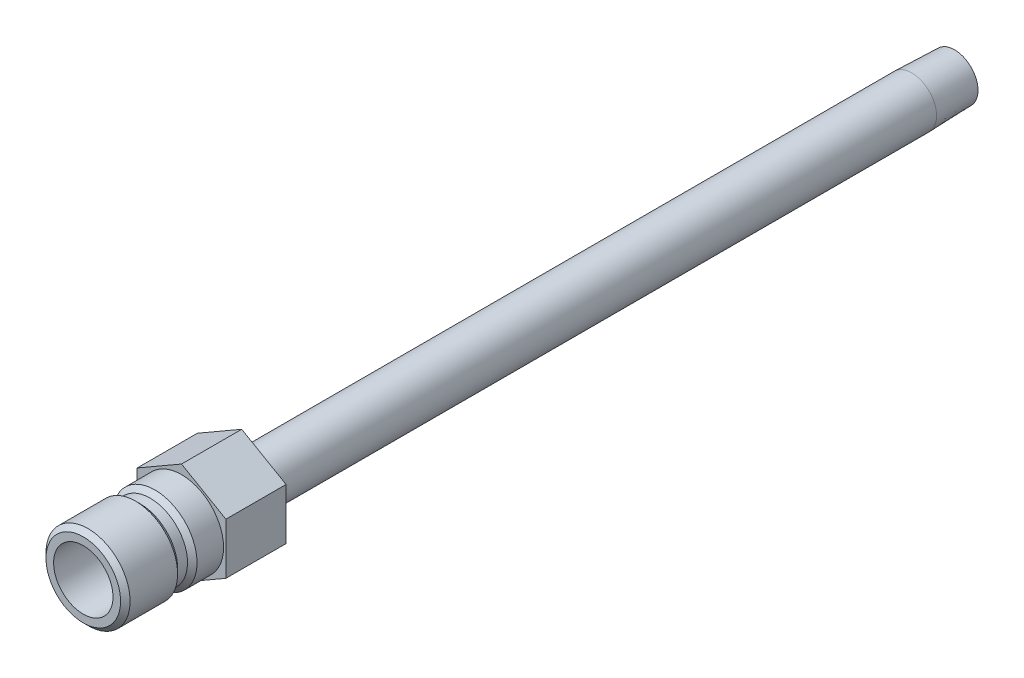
ISO-10303-21;
HEADER;
FILE_DESCRIPTION(('STEP AP214'),'2;1');
FILE_NAME('part.step','',(''),(''),'','','');
FILE_SCHEMA(('AUTOMOTIVE_DESIGN { 1 0 10303 214 1 1 1 1 }'));
ENDSEC;
DATA;
#1=APPLICATION_CONTEXT('core data for automotive mechanical design processes');
#2=APPLICATION_PROTOCOL_DEFINITION('international standard','automotive_design',2000,#1);
#3=PRODUCT_CONTEXT('',#1,'mechanical');
#4=PRODUCT('Part','Part','',(#3));
#5=PRODUCT_RELATED_PRODUCT_CATEGORY('part','',(#4));
#6=PRODUCT_DEFINITION_FORMATION('','',#4);
#7=PRODUCT_DEFINITION_CONTEXT('part definition',#1,'design');
#8=PRODUCT_DEFINITION('design','',#6,#7);
#9=PRODUCT_DEFINITION_SHAPE('','',#8);
#10=(LENGTH_UNIT() NAMED_UNIT(*) SI_UNIT(.MILLI.,.METRE.));
#11=(NAMED_UNIT(*) PLANE_ANGLE_UNIT() SI_UNIT($,.RADIAN.));
#12=(NAMED_UNIT(*) SI_UNIT($,.STERADIAN.) SOLID_ANGLE_UNIT());
#13=UNCERTAINTY_MEASURE_WITH_UNIT(LENGTH_MEASURE(1.E-05),#10,'distance_accuracy_value','');
#14=(GEOMETRIC_REPRESENTATION_CONTEXT(3) GLOBAL_UNCERTAINTY_ASSIGNED_CONTEXT((#13)) GLOBAL_UNIT_ASSIGNED_CONTEXT((#10,
#11,#12)) REPRESENTATION_CONTEXT('',''));
#15=CARTESIAN_POINT('',(0.,0.,0.));
#16=DIRECTION('',(0.,0.,1.));
#17=DIRECTION('',(1.,0.,0.));
#18=AXIS2_PLACEMENT_3D('',#15,#16,#17);
#19=CARTESIAN_POINT('',(0.,0.,-9.652));
#20=DIRECTION('',(0.,0.,-1.));
#21=DIRECTION('',(0.,1.,0.));
#22=AXIS2_PLACEMENT_3D('',#19,#20,#21);
#23=CYLINDRICAL_SURFACE('',#22,2.65430000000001);
#24=CARTESIAN_POINT('',(0.,0.,2.43505017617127));
#25=DIRECTION('',(0.,0.,-1.));
#26=DIRECTION('',(0.,1.,0.));
#27=AXIS2_PLACEMENT_3D('',#24,#25,#26);
#28=CIRCLE('',#27,2.6543);
#29=CARTESIAN_POINT('',(0.,2.6543,2.43505017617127));
#30=VERTEX_POINT('',#29);
#31=EDGE_CURVE('E41',#30,#30,#28,.T.);
#32=ORIENTED_EDGE('',*,*,#31,.F.);
#33=EDGE_LOOP('',(#32));
#34=FACE_BOUND('',#33,.T.);
#35=CARTESIAN_POINT('',(0.,0.,-123.952));
#36=DIRECTION('',(0.,0.,-1.));
#37=DIRECTION('',(0.,1.,0.));
#38=AXIS2_PLACEMENT_3D('',#35,#36,#37);
#39=CIRCLE('',#38,2.65430000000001);
#40=CARTESIAN_POINT('',(0.,2.65430000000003,-123.952));
#41=VERTEX_POINT('',#40);
#42=EDGE_CURVE('E137',#41,#41,#39,.T.);
#43=ORIENTED_EDGE('',*,*,#42,.T.);
#44=EDGE_LOOP('',(#43));
#45=FACE_BOUND('',#44,.T.);
#46=ADVANCED_FACE('F33',(#34,#45),#23,.F.);
#47=CARTESIAN_POINT('',(0.,0.,3.556));
#48=DIRECTION('',(0.,0.,1.));
#49=DIRECTION('',(0.,-1.,0.));
#50=AXIS2_PLACEMENT_3D('',#47,#48,#49);
#51=CONICAL_SURFACE('',#50,4.7625,1.08210413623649);
#52=ORIENTED_EDGE('',*,*,#31,.T.);
#53=EDGE_LOOP('',(#52));
#54=FACE_BOUND('',#53,.T.);
#55=CARTESIAN_POINT('',(0.,0.,3.556));
#56=DIRECTION('',(0.,0.,-1.));
#57=DIRECTION('',(0.,1.,0.));
#58=AXIS2_PLACEMENT_3D('',#55,#56,#57);
#59=CIRCLE('',#58,4.7625);
#60=CARTESIAN_POINT('',(0.,4.7625,3.556));
#61=VERTEX_POINT('',#60);
#62=EDGE_CURVE('E175',#61,#61,#59,.T.);
#63=ORIENTED_EDGE('',*,*,#62,.F.);
#64=EDGE_LOOP('',(#63));
#65=FACE_BOUND('',#64,.T.);
#66=ADVANCED_FACE('F180',(#54,#65),#51,.F.);
#67=CARTESIAN_POINT('',(0.,0.,-9.652));
#68=DIRECTION('',(0.,0.,-1.));
#69=DIRECTION('',(0.,1.,0.));
#70=AXIS2_PLACEMENT_3D('',#67,#68,#69);
#71=CYLINDRICAL_SURFACE('',#70,4.7625);
#72=ORIENTED_EDGE('',*,*,#62,.T.);
#73=EDGE_LOOP('',(#72));
#74=FACE_BOUND('',#73,.T.);
#75=CARTESIAN_POINT('',(0.,0.,15.748));
#76=DIRECTION('',(0.,0.,-1.));
#77=DIRECTION('',(0.,1.,0.));
#78=AXIS2_PLACEMENT_3D('',#75,#76,#77);
#79=CIRCLE('',#78,4.7625);
#80=CARTESIAN_POINT('',(0.,4.7625,15.748));
#81=VERTEX_POINT('',#80);
#82=EDGE_CURVE('E172',#81,#81,#79,.T.);
#83=ORIENTED_EDGE('',*,*,#82,.F.);
#84=EDGE_LOOP('',(#83));
#85=FACE_BOUND('',#84,.T.);
#86=ADVANCED_FACE('F237',(#74,#85),#71,.F.);
#87=CARTESIAN_POINT('',(0.,4.7625,15.748));
#88=DIRECTION('',(0.,0.,1.));
#89=DIRECTION('',(0.,-1.,0.));
#90=AXIS2_PLACEMENT_3D('',#87,#88,#89);
#91=PLANE('',#90);
#92=ORIENTED_EDGE('',*,*,#82,.T.);
#93=EDGE_LOOP('',(#92));
#94=FACE_BOUND('',#93,.T.);
#95=CARTESIAN_POINT('',(0.,0.,15.748));
#96=DIRECTION('',(0.,0.,-1.));
#97=DIRECTION('',(0.,1.,0.));
#98=AXIS2_PLACEMENT_3D('',#95,#96,#97);
#99=CIRCLE('',#98,5.9817);
#100=CARTESIAN_POINT('',(0.,5.9817,15.748));
#101=VERTEX_POINT('',#100);
#102=EDGE_CURVE('E169',#101,#101,#99,.T.);
#103=ORIENTED_EDGE('',*,*,#102,.F.);
#104=EDGE_LOOP('',(#103));
#105=FACE_BOUND('',#104,.T.);
#106=ADVANCED_FACE('F233',(#94,#105),#91,.T.);
#107=CARTESIAN_POINT('',(0.,0.,14.986));
#108=DIRECTION('',(0.,0.,-1.));
#109=DIRECTION('',(0.,1.,0.));
#110=AXIS2_PLACEMENT_3D('',#107,#108,#109);
#111=CONICAL_SURFACE('',#110,6.7437,0.785398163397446);
#112=ORIENTED_EDGE('',*,*,#102,.T.);
#113=EDGE_LOOP('',(#112));
#114=FACE_BOUND('',#113,.T.);
#115=CARTESIAN_POINT('',(0.,0.,14.986));
#116=DIRECTION('',(0.,0.,-1.));
#117=DIRECTION('',(0.,1.,0.));
#118=AXIS2_PLACEMENT_3D('',#115,#116,#117);
#119=CIRCLE('',#118,6.7437);
#120=CARTESIAN_POINT('',(0.,6.7437,14.986));
#121=VERTEX_POINT('',#120);
#122=EDGE_CURVE('E166',#121,#121,#119,.T.);
#123=ORIENTED_EDGE('',*,*,#122,.F.);
#124=EDGE_LOOP('',(#123));
#125=FACE_BOUND('',#124,.T.);
#126=ADVANCED_FACE('F229',(#114,#125),#111,.T.);
#127=CARTESIAN_POINT('',(0.,0.,-9.652));
#128=DIRECTION('',(0.,0.,-1.));
#129=DIRECTION('',(0.,1.,0.));
#130=AXIS2_PLACEMENT_3D('',#127,#128,#129);
#131=CYLINDRICAL_SURFACE('',#130,6.7437);
#132=ORIENTED_EDGE('',*,*,#122,.T.);
#133=EDGE_LOOP('',(#132));
#134=FACE_BOUND('',#133,.T.);
#135=CARTESIAN_POINT('',(0.,0.,7.366));
#136=DIRECTION('',(0.,0.,-1.));
#137=DIRECTION('',(0.,1.,0.));
#138=AXIS2_PLACEMENT_3D('',#135,#136,#137);
#139=CIRCLE('',#138,6.7437);
#140=CARTESIAN_POINT('',(0.,6.7437,7.366));
#141=VERTEX_POINT('',#140);
#142=EDGE_CURVE('E163',#141,#141,#139,.T.);
#143=ORIENTED_EDGE('',*,*,#142,.F.);
#144=EDGE_LOOP('',(#143));
#145=FACE_BOUND('',#144,.T.);
#146=ADVANCED_FACE('F225',(#134,#145),#131,.T.);
#147=CARTESIAN_POINT('',(0.,0.,6.604));
#148=DIRECTION('',(0.,0.,1.));
#149=DIRECTION('',(0.,-1.,0.));
#150=AXIS2_PLACEMENT_3D('',#147,#148,#149);
#151=CONICAL_SURFACE('',#150,5.9817,0.785398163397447);
#152=ORIENTED_EDGE('',*,*,#142,.T.);
#153=EDGE_LOOP('',(#152));
#154=FACE_BOUND('',#153,.T.);
#155=CARTESIAN_POINT('',(0.,0.,6.604));
#156=DIRECTION('',(0.,0.,-1.));
#157=DIRECTION('',(0.,1.,0.));
#158=AXIS2_PLACEMENT_3D('',#155,#156,#157);
#159=CIRCLE('',#158,5.9817);
#160=CARTESIAN_POINT('',(0.,5.9817,6.604));
#161=VERTEX_POINT('',#160);
#162=EDGE_CURVE('E160',#161,#161,#159,.T.);
#163=ORIENTED_EDGE('',*,*,#162,.F.);
#164=EDGE_LOOP('',(#163));
#165=FACE_BOUND('',#164,.T.);
#166=ADVANCED_FACE('F221',(#154,#165),#151,.T.);
#167=CARTESIAN_POINT('',(0.,0.,-9.652));
#168=DIRECTION('',(0.,0.,-1.));
#169=DIRECTION('',(0.,1.,0.));
#170=AXIS2_PLACEMENT_3D('',#167,#168,#169);
#171=CYLINDRICAL_SURFACE('',#170,5.9817);
#172=ORIENTED_EDGE('',*,*,#162,.T.);
#173=EDGE_LOOP('',(#172));
#174=FACE_BOUND('',#173,.T.);
#175=CARTESIAN_POINT('',(0.,0.,5.0165));
#176=DIRECTION('',(0.,0.,-1.));
#177=DIRECTION('',(0.,1.,0.));
#178=AXIS2_PLACEMENT_3D('',#175,#176,#177);
#179=CIRCLE('',#178,5.9817);
#180=CARTESIAN_POINT('',(0.,5.9817,5.0165));
#181=VERTEX_POINT('',#180);
#182=EDGE_CURVE('E157',#181,#181,#179,.T.);
#183=ORIENTED_EDGE('',*,*,#182,.F.);
#184=EDGE_LOOP('',(#183));
#185=FACE_BOUND('',#184,.T.);
#186=ADVANCED_FACE('F217',(#174,#185),#171,.T.);
#187=CARTESIAN_POINT('',(0.,0.,4.25449999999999));
#188=DIRECTION('',(0.,0.,-1.));
#189=DIRECTION('',(0.,1.,0.));
#190=AXIS2_PLACEMENT_3D('',#187,#188,#189);
#191=CONICAL_SURFACE('',#190,6.7437,0.785398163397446);
#192=ORIENTED_EDGE('',*,*,#182,.T.);
#193=EDGE_LOOP('',(#192));
#194=FACE_BOUND('',#193,.T.);
#195=CARTESIAN_POINT('',(0.,0.,4.25449999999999));
#196=DIRECTION('',(0.,0.,-1.));
#197=DIRECTION('',(0.,1.,0.));
#198=AXIS2_PLACEMENT_3D('',#195,#196,#197);
#199=CIRCLE('',#198,6.7437);
#200=CARTESIAN_POINT('',(0.,6.7437,4.25449999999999));
#201=VERTEX_POINT('',#200);
#202=EDGE_CURVE('E154',#201,#201,#199,.T.);
#203=ORIENTED_EDGE('',*,*,#202,.F.);
#204=EDGE_LOOP('',(#203));
#205=FACE_BOUND('',#204,.T.);
#206=ADVANCED_FACE('F213',(#194,#205),#191,.T.);
#207=CARTESIAN_POINT('',(0.,0.,-9.652));
#208=DIRECTION('',(0.,0.,-1.));
#209=DIRECTION('',(0.,1.,0.));
#210=AXIS2_PLACEMENT_3D('',#207,#208,#209);
#211=CYLINDRICAL_SURFACE('',#210,6.7437);
#212=CARTESIAN_POINT('',(0.,0.,0.));
#213=DIRECTION('',(0.,0.,1.));
#214=DIRECTION('',(1.,0.,0.));
#215=AXIS2_PLACEMENT_3D('',#212,#213,#214);
#216=CIRCLE('',#215,6.7437);
#217=CARTESIAN_POINT('',(6.7437,0.,0.));
#218=VERTEX_POINT('',#217);
#219=EDGE_CURVE('E11',#218,#218,#216,.F.);
#220=ORIENTED_EDGE('',*,*,#219,.F.);
#221=EDGE_LOOP('',(#220));
#222=FACE_BOUND('',#221,.T.);
#223=ORIENTED_EDGE('',*,*,#202,.T.);
#224=EDGE_LOOP('',(#223));
#225=FACE_BOUND('',#224,.T.);
#226=ADVANCED_FACE('F209',(#222,#225),#211,.T.);
#227=CARTESIAN_POINT('',(0.,6.7437,-9.652));
#228=DIRECTION('',(0.,0.,-1.));
#229=DIRECTION('',(0.,1.,0.));
#230=AXIS2_PLACEMENT_3D('',#227,#228,#229);
#231=PLANE('',#230);
#232=CARTESIAN_POINT('',(0.,0.,-9.652));
#233=DIRECTION('',(0.,0.,-1.));
#234=DIRECTION('',(0.,1.,0.));
#235=AXIS2_PLACEMENT_3D('',#232,#233,#234);
#236=CIRCLE('',#235,3.96875);
#237=CARTESIAN_POINT('',(0.,3.96875,-9.652));
#238=VERTEX_POINT('',#237);
#239=EDGE_CURVE('E151',#238,#238,#236,.T.);
#240=ORIENTED_EDGE('',*,*,#239,.F.);
#241=EDGE_LOOP('',(#240));
#242=FACE_BOUND('',#241,.T.);
#243=DIRECTION('',(-0.866025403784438,-0.5,0.));
#244=VECTOR('',#243,1.);
#245=CARTESIAN_POINT('',(0.,8.21223022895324,-9.652));
#246=LINE('',#245,#244);
#247=CARTESIAN_POINT('',(0.,8.21223022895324,-9.652));
#248=VERTEX_POINT('',#247);
#249=CARTESIAN_POINT('',(-7.112,4.10611511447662,-9.652));
#250=VERTEX_POINT('',#249);
#251=EDGE_CURVE('E135',#248,#250,#246,.T.);
#252=ORIENTED_EDGE('',*,*,#251,.F.);
#253=DIRECTION('',(-0.866025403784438,0.5,0.));
#254=VECTOR('',#253,1.);
#255=CARTESIAN_POINT('',(7.112,4.10611511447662,-9.652));
#256=LINE('',#255,#254);
#257=CARTESIAN_POINT('',(7.112,4.10611511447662,-9.652));
#258=VERTEX_POINT('',#257);
#259=EDGE_CURVE('E110',#258,#248,#256,.T.);
#260=ORIENTED_EDGE('',*,*,#259,.F.);
#261=DIRECTION('',(0.,1.,0.));
#262=VECTOR('',#261,1.);
#263=CARTESIAN_POINT('',(7.112,-4.10611511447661,-9.652));
#264=LINE('',#263,#262);
#265=CARTESIAN_POINT('',(7.112,-4.10611511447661,-9.652));
#266=VERTEX_POINT('',#265);
#267=EDGE_CURVE('E95',#266,#258,#264,.T.);
#268=ORIENTED_EDGE('',*,*,#267,.F.);
#269=DIRECTION('',(0.866025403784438,0.5,0.));
#270=VECTOR('',#269,1.);
#271=CARTESIAN_POINT('',(0.,-8.21223022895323,-9.652));
#272=LINE('',#271,#270);
#273=CARTESIAN_POINT('',(0.,-8.21223022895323,-9.652));
#274=VERTEX_POINT('',#273);
#275=EDGE_CURVE('E108',#274,#266,#272,.T.);
#276=ORIENTED_EDGE('',*,*,#275,.F.);
#277=DIRECTION('',(0.866025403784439,-0.5,0.));
#278=VECTOR('',#277,1.);
#279=CARTESIAN_POINT('',(-7.112,-4.10611511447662,-9.652));
#280=LINE('',#279,#278);
#281=CARTESIAN_POINT('',(-7.112,-4.10611511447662,-9.652));
#282=VERTEX_POINT('',#281);
#283=EDGE_CURVE('E113',#282,#274,#280,.T.);
#284=ORIENTED_EDGE('',*,*,#283,.F.);
#285=DIRECTION('',(0.,-1.,0.));
#286=VECTOR('',#285,1.);
#287=CARTESIAN_POINT('',(-7.112,4.10611511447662,-9.652));
#288=LINE('',#287,#286);
#289=EDGE_CURVE('E115',#250,#282,#288,.T.);
#290=ORIENTED_EDGE('',*,*,#289,.F.);
#291=EDGE_LOOP('',(#252,#260,#268,#276,#284,#290));
#292=FACE_BOUND('',#291,.T.);
#293=ADVANCED_FACE('F106',(#242,#292),#231,.T.);
#294=CARTESIAN_POINT('',(0.,0.,-9.652));
#295=DIRECTION('',(0.,0.,-1.));
#296=DIRECTION('',(0.,1.,0.));
#297=AXIS2_PLACEMENT_3D('',#294,#295,#296);
#298=CYLINDRICAL_SURFACE('',#297,3.96874999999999);
#299=ORIENTED_EDGE('',*,*,#239,.T.);
#300=EDGE_LOOP('',(#299));
#301=FACE_BOUND('',#300,.T.);
#302=CARTESIAN_POINT('',(0.,0.,-117.094));
#303=DIRECTION('',(0.,0.,-1.));
#304=DIRECTION('',(0.,1.,0.));
#305=AXIS2_PLACEMENT_3D('',#302,#303,#304);
#306=CIRCLE('',#305,3.96874999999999);
#307=CARTESIAN_POINT('',(0.,3.96875,-117.094));
#308=VERTEX_POINT('',#307);
#309=EDGE_CURVE('E148',#308,#308,#306,.T.);
#310=ORIENTED_EDGE('',*,*,#309,.F.);
#311=EDGE_LOOP('',(#310));
#312=FACE_BOUND('',#311,.T.);
#313=ADVANCED_FACE('F199',(#301,#312),#298,.T.);
#314=CARTESIAN_POINT('',(0.,0.,-123.952));
#315=DIRECTION('',(0.,0.,1.));
#316=DIRECTION('',(0.,-1.,0.));
#317=AXIS2_PLACEMENT_3D('',#314,#315,#316);
#318=CONICAL_SURFACE('',#317,3.75443877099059,0.0312396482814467);
#319=ORIENTED_EDGE('',*,*,#309,.T.);
#320=EDGE_LOOP('',(#319));
#321=FACE_BOUND('',#320,.T.);
#322=CARTESIAN_POINT('',(0.,0.,-123.952));
#323=DIRECTION('',(0.,0.,-1.));
#324=DIRECTION('',(0.,1.,0.));
#325=AXIS2_PLACEMENT_3D('',#322,#323,#324);
#326=CIRCLE('',#325,3.75443877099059);
#327=CARTESIAN_POINT('',(0.,3.7544387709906,-123.952));
#328=VERTEX_POINT('',#327);
#329=EDGE_CURVE('E145',#328,#328,#326,.T.);
#330=ORIENTED_EDGE('',*,*,#329,.F.);
#331=EDGE_LOOP('',(#330));
#332=FACE_BOUND('',#331,.T.);
#333=ADVANCED_FACE('F190',(#321,#332),#318,.T.);
#334=CARTESIAN_POINT('',(0.,3.7544387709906,-123.952));
#335=DIRECTION('',(0.,0.,-1.));
#336=DIRECTION('',(0.,1.,0.));
#337=AXIS2_PLACEMENT_3D('',#334,#335,#336);
#338=PLANE('',#337);
#339=ORIENTED_EDGE('',*,*,#329,.T.);
#340=EDGE_LOOP('',(#339));
#341=FACE_BOUND('',#340,.T.);
#342=ORIENTED_EDGE('',*,*,#42,.F.);
#343=EDGE_LOOP('',(#342));
#344=FACE_BOUND('',#343,.T.);
#345=ADVANCED_FACE('F187',(#341,#344),#338,.T.);
#346=CARTESIAN_POINT('',(0.,8.21223022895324,-9.652));
#347=DIRECTION('',(-0.5,0.866025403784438,0.));
#348=DIRECTION('',(-0.866025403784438,-0.5,0.));
#349=AXIS2_PLACEMENT_3D('',#346,#347,#348);
#350=PLANE('',#349);
#351=DIRECTION('',(-0.866025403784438,-0.5,0.));
#352=VECTOR('',#351,1.);
#353=CARTESIAN_POINT('',(0.,8.21223022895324,0.));
#354=LINE('',#353,#352);
#355=CARTESIAN_POINT('',(0.,8.21223022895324,0.));
#356=VERTEX_POINT('',#355);
#357=CARTESIAN_POINT('',(-7.112,4.10611511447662,0.));
#358=VERTEX_POINT('',#357);
#359=EDGE_CURVE('E120',#356,#358,#354,.T.);
#360=ORIENTED_EDGE('',*,*,#359,.F.);
#361=DIRECTION('',(0.,0.,1.));
#362=VECTOR('',#361,1.);
#363=CARTESIAN_POINT('',(0.,8.21223022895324,-9.652));
#364=LINE('',#363,#362);
#365=EDGE_CURVE('E49',#248,#356,#364,.T.);
#366=ORIENTED_EDGE('',*,*,#365,.F.);
#367=ORIENTED_EDGE('',*,*,#251,.T.);
#368=DIRECTION('',(0.,0.,1.));
#369=VECTOR('',#368,1.);
#370=CARTESIAN_POINT('',(-7.112,4.10611511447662,-9.652));
#371=LINE('',#370,#369);
#372=EDGE_CURVE('E84',#250,#358,#371,.T.);
#373=ORIENTED_EDGE('',*,*,#372,.T.);
#374=EDGE_LOOP('',(#360,#366,#367,#373));
#375=FACE_BOUND('',#374,.T.);
#376=ADVANCED_FACE('F189',(#375),#350,.T.);
#377=CARTESIAN_POINT('',(7.112,4.10611511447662,-9.652));
#378=DIRECTION('',(0.5,0.866025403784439,0.));
#379=DIRECTION('',(-0.866025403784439,0.5,0.));
#380=AXIS2_PLACEMENT_3D('',#377,#378,#379);
#381=PLANE('',#380);
#382=DIRECTION('',(-0.866025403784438,0.5,0.));
#383=VECTOR('',#382,1.);
#384=CARTESIAN_POINT('',(7.112,4.10611511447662,0.));
#385=LINE('',#384,#383);
#386=CARTESIAN_POINT('',(7.112,4.10611511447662,0.));
#387=VERTEX_POINT('',#386);
#388=EDGE_CURVE('E132',#387,#356,#385,.T.);
#389=ORIENTED_EDGE('',*,*,#388,.F.);
#390=DIRECTION('',(0.,0.,1.));
#391=VECTOR('',#390,1.);
#392=CARTESIAN_POINT('',(7.112,4.10611511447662,-9.652));
#393=LINE('',#392,#391);
#394=EDGE_CURVE('E72',#258,#387,#393,.T.);
#395=ORIENTED_EDGE('',*,*,#394,.F.);
#396=ORIENTED_EDGE('',*,*,#259,.T.);
#397=ORIENTED_EDGE('',*,*,#365,.T.);
#398=EDGE_LOOP('',(#389,#395,#396,#397));
#399=FACE_BOUND('',#398,.T.);
#400=ADVANCED_FACE('F197',(#399),#381,.T.);
#401=CARTESIAN_POINT('',(7.112,-4.10611511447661,-9.652));
#402=DIRECTION('',(1.,0.,0.));
#403=DIRECTION('',(0.,1.,0.));
#404=AXIS2_PLACEMENT_3D('',#401,#402,#403);
#405=PLANE('',#404);
#406=DIRECTION('',(0.,1.,0.));
#407=VECTOR('',#406,1.);
#408=CARTESIAN_POINT('',(7.112,-4.10611511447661,0.));
#409=LINE('',#408,#407);
#410=CARTESIAN_POINT('',(7.112,-4.10611511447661,0.));
#411=VERTEX_POINT('',#410);
#412=EDGE_CURVE('E97',#411,#387,#409,.T.);
#413=ORIENTED_EDGE('',*,*,#412,.F.);
#414=DIRECTION('',(0.,0.,1.));
#415=VECTOR('',#414,1.);
#416=CARTESIAN_POINT('',(7.112,-4.10611511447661,-9.652));
#417=LINE('',#416,#415);
#418=EDGE_CURVE('E92',#266,#411,#417,.T.);
#419=ORIENTED_EDGE('',*,*,#418,.F.);
#420=ORIENTED_EDGE('',*,*,#267,.T.);
#421=ORIENTED_EDGE('',*,*,#394,.T.);
#422=EDGE_LOOP('',(#413,#419,#420,#421));
#423=FACE_BOUND('',#422,.T.);
#424=ADVANCED_FACE('F94',(#423),#405,.T.);
#425=CARTESIAN_POINT('',(0.,-8.21223022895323,-9.652));
#426=DIRECTION('',(0.5,-0.866025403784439,0.));
#427=DIRECTION('',(0.866025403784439,0.5,0.));
#428=AXIS2_PLACEMENT_3D('',#425,#426,#427);
#429=PLANE('',#428);
#430=DIRECTION('',(0.866025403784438,0.5,0.));
#431=VECTOR('',#430,1.);
#432=CARTESIAN_POINT('',(0.,-8.21223022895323,0.));
#433=LINE('',#432,#431);
#434=CARTESIAN_POINT('',(0.,-8.21223022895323,0.));
#435=VERTEX_POINT('',#434);
#436=EDGE_CURVE('E129',#435,#411,#433,.T.);
#437=ORIENTED_EDGE('',*,*,#436,.F.);
#438=DIRECTION('',(0.,0.,1.));
#439=VECTOR('',#438,1.);
#440=CARTESIAN_POINT('',(0.,-8.21223022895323,-9.652));
#441=LINE('',#440,#439);
#442=EDGE_CURVE('E102',#274,#435,#441,.T.);
#443=ORIENTED_EDGE('',*,*,#442,.F.);
#444=ORIENTED_EDGE('',*,*,#275,.T.);
#445=ORIENTED_EDGE('',*,*,#418,.T.);
#446=EDGE_LOOP('',(#437,#443,#444,#445));
#447=FACE_BOUND('',#446,.T.);
#448=ADVANCED_FACE('F112',(#447),#429,.T.);
#449=CARTESIAN_POINT('',(-7.112,-4.10611511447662,-9.652));
#450=DIRECTION('',(-0.5,-0.866025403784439,0.));
#451=DIRECTION('',(0.866025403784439,-0.5,0.));
#452=AXIS2_PLACEMENT_3D('',#449,#450,#451);
#453=PLANE('',#452);
#454=DIRECTION('',(0.866025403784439,-0.5,0.));
#455=VECTOR('',#454,1.);
#456=CARTESIAN_POINT('',(-7.112,-4.10611511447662,0.));
#457=LINE('',#456,#455);
#458=CARTESIAN_POINT('',(-7.112,-4.10611511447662,0.));
#459=VERTEX_POINT('',#458);
#460=EDGE_CURVE('E126',#459,#435,#457,.T.);
#461=ORIENTED_EDGE('',*,*,#460,.F.);
#462=DIRECTION('',(0.,0.,1.));
#463=VECTOR('',#462,1.);
#464=CARTESIAN_POINT('',(-7.112,-4.10611511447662,-9.652));
#465=LINE('',#464,#463);
#466=EDGE_CURVE('E140',#282,#459,#465,.T.);
#467=ORIENTED_EDGE('',*,*,#466,.F.);
#468=ORIENTED_EDGE('',*,*,#283,.T.);
#469=ORIENTED_EDGE('',*,*,#442,.T.);
#470=EDGE_LOOP('',(#461,#467,#468,#469));
#471=FACE_BOUND('',#470,.T.);
#472=ADVANCED_FACE('F352',(#471),#453,.T.);
#473=CARTESIAN_POINT('',(-7.112,4.10611511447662,-9.652));
#474=DIRECTION('',(-1.,0.,0.));
#475=DIRECTION('',(0.,-1.,0.));
#476=AXIS2_PLACEMENT_3D('',#473,#474,#475);
#477=PLANE('',#476);
#478=DIRECTION('',(0.,-1.,0.));
#479=VECTOR('',#478,1.);
#480=CARTESIAN_POINT('',(-7.112,4.10611511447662,0.));
#481=LINE('',#480,#479);
#482=EDGE_CURVE('E123',#358,#459,#481,.T.);
#483=ORIENTED_EDGE('',*,*,#482,.F.);
#484=ORIENTED_EDGE('',*,*,#372,.F.);
#485=ORIENTED_EDGE('',*,*,#289,.T.);
#486=ORIENTED_EDGE('',*,*,#466,.T.);
#487=EDGE_LOOP('',(#483,#484,#485,#486));
#488=FACE_BOUND('',#487,.T.);
#489=ADVANCED_FACE('F360',(#488),#477,.T.);
#490=CARTESIAN_POINT('',(-7.112,4.10611511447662,0.));
#491=DIRECTION('',(0.,0.,1.));
#492=DIRECTION('',(1.,0.,0.));
#493=AXIS2_PLACEMENT_3D('',#490,#491,#492);
#494=PLANE('',#493);
#495=ORIENTED_EDGE('',*,*,#219,.T.);
#496=EDGE_LOOP('',(#495));
#497=FACE_BOUND('',#496,.T.);
#498=ORIENTED_EDGE('',*,*,#359,.T.);
#499=ORIENTED_EDGE('',*,*,#482,.T.);
#500=ORIENTED_EDGE('',*,*,#460,.T.);
#501=ORIENTED_EDGE('',*,*,#436,.T.);
#502=ORIENTED_EDGE('',*,*,#412,.T.);
#503=ORIENTED_EDGE('',*,*,#388,.T.);
#504=EDGE_LOOP('',(#498,#499,#500,#501,#502,#503));
#505=FACE_BOUND('',#504,.T.);
#506=ADVANCED_FACE('F369',(#497,#505),#494,.T.);
#507=CLOSED_SHELL('',(#46,#66,#86,#106,#126,#146,#166,#186,#206,#226,#293,#313,#333,#345,#376,
#400,#424,#448,#472,#489,#506));
#508=MANIFOLD_SOLID_BREP('B2',#507);
#509=ADVANCED_BREP_SHAPE_REPRESENTATION('',(#18,#508),#14);
#510=SHAPE_DEFINITION_REPRESENTATION(#9,#509);
ENDSEC;
END-ISO-10303-21;
